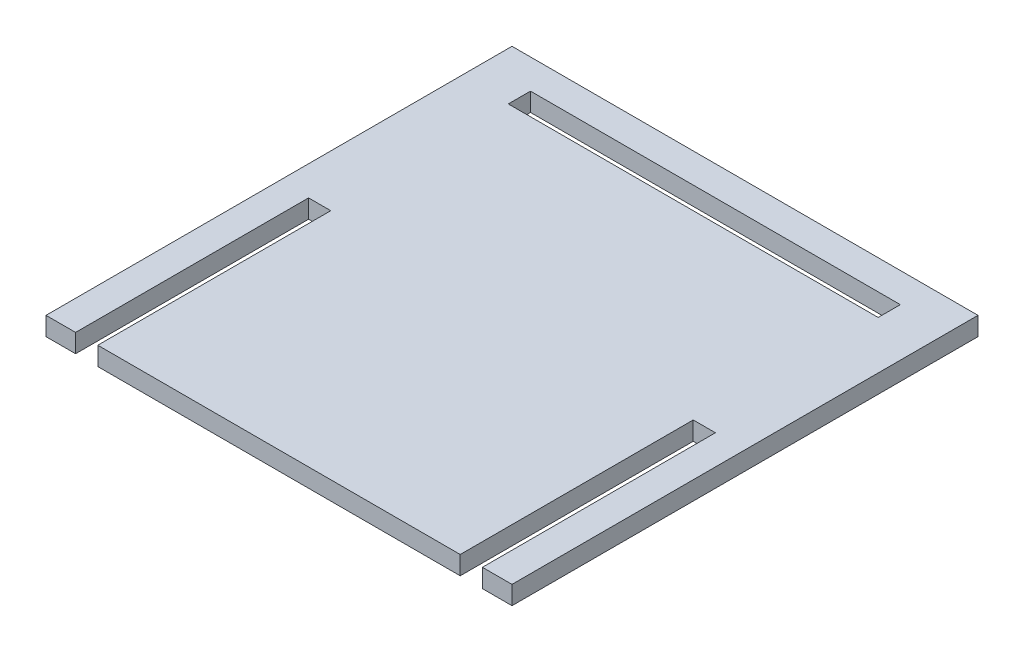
ISO-10303-21;
HEADER;
FILE_DESCRIPTION(('STEP AP214'),'2;1');
FILE_NAME('part.step','',(''),(''),'','','');
FILE_SCHEMA(('AUTOMOTIVE_DESIGN { 1 0 10303 214 1 1 1 1 }'));
ENDSEC;
DATA;
#1=APPLICATION_CONTEXT('core data for automotive mechanical design processes');
#2=APPLICATION_PROTOCOL_DEFINITION('international standard','automotive_design',2000,#1);
#3=PRODUCT_CONTEXT('',#1,'mechanical');
#4=PRODUCT('Part','Part','',(#3));
#5=PRODUCT_RELATED_PRODUCT_CATEGORY('part','',(#4));
#6=PRODUCT_DEFINITION_FORMATION('','',#4);
#7=PRODUCT_DEFINITION_CONTEXT('part definition',#1,'design');
#8=PRODUCT_DEFINITION('design','',#6,#7);
#9=PRODUCT_DEFINITION_SHAPE('','',#8);
#10=(LENGTH_UNIT() NAMED_UNIT(*) SI_UNIT(.MILLI.,.METRE.));
#11=(NAMED_UNIT(*) PLANE_ANGLE_UNIT() SI_UNIT($,.RADIAN.));
#12=(NAMED_UNIT(*) SI_UNIT($,.STERADIAN.) SOLID_ANGLE_UNIT());
#13=UNCERTAINTY_MEASURE_WITH_UNIT(LENGTH_MEASURE(1.E-05),#10,'distance_accuracy_value','');
#14=(GEOMETRIC_REPRESENTATION_CONTEXT(3) GLOBAL_UNCERTAINTY_ASSIGNED_CONTEXT((#13)) GLOBAL_UNIT_ASSIGNED_CONTEXT((#10,
#11,#12)) REPRESENTATION_CONTEXT('',''));
#15=CARTESIAN_POINT('',(0.,0.,0.));
#16=DIRECTION('',(0.,0.,1.));
#17=DIRECTION('',(1.,0.,0.));
#18=AXIS2_PLACEMENT_3D('',#15,#16,#17);
#19=CARTESIAN_POINT('',(0.,2.5,0.));
#20=DIRECTION('',(0.,-1.,0.));
#21=DIRECTION('',(0.,0.,-1.));
#22=AXIS2_PLACEMENT_3D('',#19,#20,#21);
#23=PLANE('',#22);
#24=DIRECTION('',(1.,0.,0.));
#25=VECTOR('',#24,1.);
#26=CARTESIAN_POINT('',(27.5,2.5,31.5));
#27=LINE('',#26,#25);
#28=CARTESIAN_POINT('',(27.5,2.5,31.5));
#29=VERTEX_POINT('',#28);
#30=CARTESIAN_POINT('',(31.5,2.5,31.5));
#31=VERTEX_POINT('',#30);
#32=EDGE_CURVE('E183',#29,#31,#27,.T.);
#33=ORIENTED_EDGE('',*,*,#32,.T.);
#34=DIRECTION('',(0.,0.,-1.));
#35=VECTOR('',#34,1.);
#36=CARTESIAN_POINT('',(31.5,2.5,-31.5));
#37=LINE('',#36,#35);
#38=CARTESIAN_POINT('',(31.5,2.5,-31.5));
#39=VERTEX_POINT('',#38);
#40=EDGE_CURVE('E186',#31,#39,#37,.T.);
#41=ORIENTED_EDGE('',*,*,#40,.T.);
#42=DIRECTION('',(-1.,0.,0.));
#43=VECTOR('',#42,1.);
#44=CARTESIAN_POINT('',(-31.5,2.5,-31.5));
#45=LINE('',#44,#43);
#46=CARTESIAN_POINT('',(-31.5,2.5,-31.5));
#47=VERTEX_POINT('',#46);
#48=EDGE_CURVE('E189',#39,#47,#45,.T.);
#49=ORIENTED_EDGE('',*,*,#48,.T.);
#50=DIRECTION('',(0.,0.,1.));
#51=VECTOR('',#50,1.);
#52=CARTESIAN_POINT('',(-31.5,2.5,-31.5));
#53=LINE('',#52,#51);
#54=CARTESIAN_POINT('',(-31.5,2.5,31.5));
#55=VERTEX_POINT('',#54);
#56=EDGE_CURVE('E191',#47,#55,#53,.T.);
#57=ORIENTED_EDGE('',*,*,#56,.T.);
#58=DIRECTION('',(1.,0.,0.));
#59=VECTOR('',#58,1.);
#60=CARTESIAN_POINT('',(-31.5,2.5,31.5));
#61=LINE('',#60,#59);
#62=CARTESIAN_POINT('',(-27.5,2.5,31.5));
#63=VERTEX_POINT('',#62);
#64=EDGE_CURVE('E193',#55,#63,#61,.T.);
#65=ORIENTED_EDGE('',*,*,#64,.T.);
#66=DIRECTION('',(0.,0.,-1.));
#67=VECTOR('',#66,1.);
#68=CARTESIAN_POINT('',(-27.5,2.5,31.5));
#69=LINE('',#68,#67);
#70=CARTESIAN_POINT('',(-27.5,2.5,0.));
#71=VERTEX_POINT('',#70);
#72=EDGE_CURVE('E195',#63,#71,#69,.T.);
#73=ORIENTED_EDGE('',*,*,#72,.T.);
#74=DIRECTION('',(1.,0.,0.));
#75=VECTOR('',#74,1.);
#76=CARTESIAN_POINT('',(-27.5,2.5,0.));
#77=LINE('',#76,#75);
#78=CARTESIAN_POINT('',(-24.5,2.5,0.));
#79=VERTEX_POINT('',#78);
#80=EDGE_CURVE('E197',#71,#79,#77,.T.);
#81=ORIENTED_EDGE('',*,*,#80,.T.);
#82=DIRECTION('',(0.,0.,1.));
#83=VECTOR('',#82,1.);
#84=CARTESIAN_POINT('',(-24.5,2.5,0.));
#85=LINE('',#84,#83);
#86=CARTESIAN_POINT('',(-24.5,2.5,31.5));
#87=VERTEX_POINT('',#86);
#88=EDGE_CURVE('E199',#79,#87,#85,.T.);
#89=ORIENTED_EDGE('',*,*,#88,.T.);
#90=DIRECTION('',(1.,0.,0.));
#91=VECTOR('',#90,1.);
#92=CARTESIAN_POINT('',(-24.5,2.5,31.5));
#93=LINE('',#92,#91);
#94=CARTESIAN_POINT('',(24.5,2.5,31.5));
#95=VERTEX_POINT('',#94);
#96=EDGE_CURVE('E201',#87,#95,#93,.T.);
#97=ORIENTED_EDGE('',*,*,#96,.T.);
#98=DIRECTION('',(0.,0.,-1.));
#99=VECTOR('',#98,1.);
#100=CARTESIAN_POINT('',(24.5,2.5,0.));
#101=LINE('',#100,#99);
#102=CARTESIAN_POINT('',(24.5,2.5,0.));
#103=VERTEX_POINT('',#102);
#104=EDGE_CURVE('E203',#95,#103,#101,.T.);
#105=ORIENTED_EDGE('',*,*,#104,.T.);
#106=DIRECTION('',(1.,0.,0.));
#107=VECTOR('',#106,1.);
#108=CARTESIAN_POINT('',(27.5,2.5,0.));
#109=LINE('',#108,#107);
#110=CARTESIAN_POINT('',(27.5,2.5,0.));
#111=VERTEX_POINT('',#110);
#112=EDGE_CURVE('E205',#103,#111,#109,.T.);
#113=ORIENTED_EDGE('',*,*,#112,.T.);
#114=DIRECTION('',(0.,0.,1.));
#115=VECTOR('',#114,1.);
#116=CARTESIAN_POINT('',(27.5,2.5,31.5));
#117=LINE('',#116,#115);
#118=EDGE_CURVE('E207',#111,#29,#117,.T.);
#119=ORIENTED_EDGE('',*,*,#118,.T.);
#120=EDGE_LOOP('',(#33,#41,#49,#57,#65,#73,#81,#89,#97,#105,#113,#119));
#121=FACE_BOUND('',#120,.T.);
#122=DIRECTION('',(0.,0.,-1.));
#123=VECTOR('',#122,1.);
#124=CARTESIAN_POINT('',(25.,2.5,-27.5));
#125=LINE('',#124,#123);
#126=CARTESIAN_POINT('',(25.,2.5,-24.5));
#127=VERTEX_POINT('',#126);
#128=CARTESIAN_POINT('',(25.,2.5,-27.5));
#129=VERTEX_POINT('',#128);
#130=EDGE_CURVE('E147',#127,#129,#125,.T.);
#131=ORIENTED_EDGE('',*,*,#130,.F.);
#132=DIRECTION('',(1.,0.,0.));
#133=VECTOR('',#132,1.);
#134=CARTESIAN_POINT('',(-25.,2.5,-24.5));
#135=LINE('',#134,#133);
#136=CARTESIAN_POINT('',(-25.,2.5,-24.5));
#137=VERTEX_POINT('',#136);
#138=EDGE_CURVE('E169',#137,#127,#135,.T.);
#139=ORIENTED_EDGE('',*,*,#138,.F.);
#140=DIRECTION('',(0.,0.,1.));
#141=VECTOR('',#140,1.);
#142=CARTESIAN_POINT('',(-25.,2.5,-27.5));
#143=LINE('',#142,#141);
#144=CARTESIAN_POINT('',(-25.,2.5,-27.5));
#145=VERTEX_POINT('',#144);
#146=EDGE_CURVE('E167',#145,#137,#143,.T.);
#147=ORIENTED_EDGE('',*,*,#146,.F.);
#148=DIRECTION('',(-1.,0.,0.));
#149=VECTOR('',#148,1.);
#150=CARTESIAN_POINT('',(-25.,2.5,-27.5));
#151=LINE('',#150,#149);
#152=EDGE_CURVE('E155',#129,#145,#151,.T.);
#153=ORIENTED_EDGE('',*,*,#152,.F.);
#154=EDGE_LOOP('',(#131,#139,#147,#153));
#155=FACE_BOUND('',#154,.T.);
#156=ADVANCED_FACE('F34',(#121,#155),#23,.F.);
#157=CARTESIAN_POINT('',(0.,0.,0.));
#158=DIRECTION('',(0.,-1.,0.));
#159=DIRECTION('',(0.,0.,-1.));
#160=AXIS2_PLACEMENT_3D('',#157,#158,#159);
#161=PLANE('',#160);
#162=DIRECTION('',(1.,0.,0.));
#163=VECTOR('',#162,1.);
#164=CARTESIAN_POINT('',(27.5,0.,31.5));
#165=LINE('',#164,#163);
#166=CARTESIAN_POINT('',(27.5,0.,31.5));
#167=VERTEX_POINT('',#166);
#168=CARTESIAN_POINT('',(31.5,0.,31.5));
#169=VERTEX_POINT('',#168);
#170=EDGE_CURVE('E163',#167,#169,#165,.T.);
#171=ORIENTED_EDGE('',*,*,#170,.F.);
#172=DIRECTION('',(0.,0.,1.));
#173=VECTOR('',#172,1.);
#174=CARTESIAN_POINT('',(27.5,0.,31.5));
#175=LINE('',#174,#173);
#176=CARTESIAN_POINT('',(27.5,0.,0.));
#177=VERTEX_POINT('',#176);
#178=EDGE_CURVE('E187',#177,#167,#175,.T.);
#179=ORIENTED_EDGE('',*,*,#178,.F.);
#180=DIRECTION('',(1.,0.,0.));
#181=VECTOR('',#180,1.);
#182=CARTESIAN_POINT('',(27.5,0.,0.));
#183=LINE('',#182,#181);
#184=CARTESIAN_POINT('',(24.5,0.,0.));
#185=VERTEX_POINT('',#184);
#186=EDGE_CURVE('E230',#185,#177,#183,.T.);
#187=ORIENTED_EDGE('',*,*,#186,.F.);
#188=DIRECTION('',(0.,0.,-1.));
#189=VECTOR('',#188,1.);
#190=CARTESIAN_POINT('',(24.5,0.,0.));
#191=LINE('',#190,#189);
#192=CARTESIAN_POINT('',(24.5,0.,31.5));
#193=VERTEX_POINT('',#192);
#194=EDGE_CURVE('E228',#193,#185,#191,.T.);
#195=ORIENTED_EDGE('',*,*,#194,.F.);
#196=DIRECTION('',(1.,0.,0.));
#197=VECTOR('',#196,1.);
#198=CARTESIAN_POINT('',(-24.5,0.,31.5));
#199=LINE('',#198,#197);
#200=CARTESIAN_POINT('',(-24.5,0.,31.5));
#201=VERTEX_POINT('',#200);
#202=EDGE_CURVE('E226',#201,#193,#199,.T.);
#203=ORIENTED_EDGE('',*,*,#202,.F.);
#204=DIRECTION('',(0.,0.,1.));
#205=VECTOR('',#204,1.);
#206=CARTESIAN_POINT('',(-24.5,0.,0.));
#207=LINE('',#206,#205);
#208=CARTESIAN_POINT('',(-24.5,0.,0.));
#209=VERTEX_POINT('',#208);
#210=EDGE_CURVE('E224',#209,#201,#207,.T.);
#211=ORIENTED_EDGE('',*,*,#210,.F.);
#212=DIRECTION('',(1.,0.,0.));
#213=VECTOR('',#212,1.);
#214=CARTESIAN_POINT('',(-27.5,0.,0.));
#215=LINE('',#214,#213);
#216=CARTESIAN_POINT('',(-27.5,0.,0.));
#217=VERTEX_POINT('',#216);
#218=EDGE_CURVE('E222',#217,#209,#215,.T.);
#219=ORIENTED_EDGE('',*,*,#218,.F.);
#220=DIRECTION('',(0.,0.,-1.));
#221=VECTOR('',#220,1.);
#222=CARTESIAN_POINT('',(-27.5,0.,31.5));
#223=LINE('',#222,#221);
#224=CARTESIAN_POINT('',(-27.5,0.,31.5));
#225=VERTEX_POINT('',#224);
#226=EDGE_CURVE('E220',#225,#217,#223,.T.);
#227=ORIENTED_EDGE('',*,*,#226,.F.);
#228=DIRECTION('',(1.,0.,0.));
#229=VECTOR('',#228,1.);
#230=CARTESIAN_POINT('',(-31.5,0.,31.5));
#231=LINE('',#230,#229);
#232=CARTESIAN_POINT('',(-31.5,0.,31.5));
#233=VERTEX_POINT('',#232);
#234=EDGE_CURVE('E218',#233,#225,#231,.T.);
#235=ORIENTED_EDGE('',*,*,#234,.F.);
#236=DIRECTION('',(0.,0.,1.));
#237=VECTOR('',#236,1.);
#238=CARTESIAN_POINT('',(-31.5,0.,-31.5));
#239=LINE('',#238,#237);
#240=CARTESIAN_POINT('',(-31.5,0.,-31.5));
#241=VERTEX_POINT('',#240);
#242=EDGE_CURVE('E216',#241,#233,#239,.T.);
#243=ORIENTED_EDGE('',*,*,#242,.F.);
#244=DIRECTION('',(-1.,0.,0.));
#245=VECTOR('',#244,1.);
#246=CARTESIAN_POINT('',(-31.5,0.,-31.5));
#247=LINE('',#246,#245);
#248=CARTESIAN_POINT('',(31.5,0.,-31.5));
#249=VERTEX_POINT('',#248);
#250=EDGE_CURVE('E214',#249,#241,#247,.T.);
#251=ORIENTED_EDGE('',*,*,#250,.F.);
#252=DIRECTION('',(0.,0.,-1.));
#253=VECTOR('',#252,1.);
#254=CARTESIAN_POINT('',(31.5,0.,-31.5));
#255=LINE('',#254,#253);
#256=EDGE_CURVE('E212',#169,#249,#255,.T.);
#257=ORIENTED_EDGE('',*,*,#256,.F.);
#258=EDGE_LOOP('',(#171,#179,#187,#195,#203,#211,#219,#227,#235,#243,#251,#257));
#259=FACE_BOUND('',#258,.T.);
#260=DIRECTION('',(1.,0.,0.));
#261=VECTOR('',#260,1.);
#262=CARTESIAN_POINT('',(-25.,0.,-24.5));
#263=LINE('',#262,#261);
#264=CARTESIAN_POINT('',(-25.,0.,-24.5));
#265=VERTEX_POINT('',#264);
#266=CARTESIAN_POINT('',(25.,0.,-24.5));
#267=VERTEX_POINT('',#266);
#268=EDGE_CURVE('E156',#265,#267,#263,.T.);
#269=ORIENTED_EDGE('',*,*,#268,.T.);
#270=DIRECTION('',(0.,0.,-1.));
#271=VECTOR('',#270,1.);
#272=CARTESIAN_POINT('',(25.,0.,-27.5));
#273=LINE('',#272,#271);
#274=CARTESIAN_POINT('',(25.,0.,-27.5));
#275=VERTEX_POINT('',#274);
#276=EDGE_CURVE('E57',#267,#275,#273,.T.);
#277=ORIENTED_EDGE('',*,*,#276,.T.);
#278=DIRECTION('',(-1.,0.,0.));
#279=VECTOR('',#278,1.);
#280=CARTESIAN_POINT('',(-25.,0.,-27.5));
#281=LINE('',#280,#279);
#282=CARTESIAN_POINT('',(-25.,0.,-27.5));
#283=VERTEX_POINT('',#282);
#284=EDGE_CURVE('E162',#275,#283,#281,.T.);
#285=ORIENTED_EDGE('',*,*,#284,.T.);
#286=DIRECTION('',(0.,0.,1.));
#287=VECTOR('',#286,1.);
#288=CARTESIAN_POINT('',(-25.,0.,-27.5));
#289=LINE('',#288,#287);
#290=EDGE_CURVE('E175',#283,#265,#289,.T.);
#291=ORIENTED_EDGE('',*,*,#290,.T.);
#292=EDGE_LOOP('',(#269,#277,#285,#291));
#293=FACE_BOUND('',#292,.T.);
#294=ADVANCED_FACE('F272',(#259,#293),#161,.T.);
#295=CARTESIAN_POINT('',(27.5,2.5,31.5));
#296=DIRECTION('',(0.,0.,-1.));
#297=DIRECTION('',(-1.,0.,0.));
#298=AXIS2_PLACEMENT_3D('',#295,#296,#297);
#299=PLANE('',#298);
#300=ORIENTED_EDGE('',*,*,#170,.T.);
#301=DIRECTION('',(0.,-1.,0.));
#302=VECTOR('',#301,1.);
#303=CARTESIAN_POINT('',(31.5,2.5,31.5));
#304=LINE('',#303,#302);
#305=EDGE_CURVE('E11',#31,#169,#304,.T.);
#306=ORIENTED_EDGE('',*,*,#305,.F.);
#307=ORIENTED_EDGE('',*,*,#32,.F.);
#308=DIRECTION('',(0.,-1.,0.));
#309=VECTOR('',#308,1.);
#310=CARTESIAN_POINT('',(27.5,2.5,31.5));
#311=LINE('',#310,#309);
#312=EDGE_CURVE('E209',#29,#167,#311,.T.);
#313=ORIENTED_EDGE('',*,*,#312,.T.);
#314=EDGE_LOOP('',(#300,#306,#307,#313));
#315=FACE_BOUND('',#314,.T.);
#316=ADVANCED_FACE('F36',(#315),#299,.F.);
#317=CARTESIAN_POINT('',(31.5,2.5,-31.5));
#318=DIRECTION('',(-1.,0.,0.));
#319=DIRECTION('',(0.,0.,1.));
#320=AXIS2_PLACEMENT_3D('',#317,#318,#319);
#321=PLANE('',#320);
#322=ORIENTED_EDGE('',*,*,#256,.T.);
#323=DIRECTION('',(0.,-1.,0.));
#324=VECTOR('',#323,1.);
#325=CARTESIAN_POINT('',(31.5,2.5,-31.5));
#326=LINE('',#325,#324);
#327=EDGE_CURVE('E42',#39,#249,#326,.T.);
#328=ORIENTED_EDGE('',*,*,#327,.F.);
#329=ORIENTED_EDGE('',*,*,#40,.F.);
#330=ORIENTED_EDGE('',*,*,#305,.T.);
#331=EDGE_LOOP('',(#322,#328,#329,#330));
#332=FACE_BOUND('',#331,.T.);
#333=ADVANCED_FACE('F289',(#332),#321,.F.);
#334=CARTESIAN_POINT('',(-31.5,2.5,-31.5));
#335=DIRECTION('',(0.,0.,1.));
#336=DIRECTION('',(1.,0.,0.));
#337=AXIS2_PLACEMENT_3D('',#334,#335,#336);
#338=PLANE('',#337);
#339=ORIENTED_EDGE('',*,*,#250,.T.);
#340=DIRECTION('',(0.,-1.,0.));
#341=VECTOR('',#340,1.);
#342=CARTESIAN_POINT('',(-31.5,2.5,-31.5));
#343=LINE('',#342,#341);
#344=EDGE_CURVE('E259',#47,#241,#343,.T.);
#345=ORIENTED_EDGE('',*,*,#344,.F.);
#346=ORIENTED_EDGE('',*,*,#48,.F.);
#347=ORIENTED_EDGE('',*,*,#327,.T.);
#348=EDGE_LOOP('',(#339,#345,#346,#347));
#349=FACE_BOUND('',#348,.T.);
#350=ADVANCED_FACE('F266',(#349),#338,.F.);
#351=CARTESIAN_POINT('',(-31.5,2.5,-31.5));
#352=DIRECTION('',(1.,0.,0.));
#353=DIRECTION('',(0.,0.,-1.));
#354=AXIS2_PLACEMENT_3D('',#351,#352,#353);
#355=PLANE('',#354);
#356=ORIENTED_EDGE('',*,*,#242,.T.);
#357=DIRECTION('',(0.,-1.,0.));
#358=VECTOR('',#357,1.);
#359=CARTESIAN_POINT('',(-31.5,2.5,31.5));
#360=LINE('',#359,#358);
#361=EDGE_CURVE('E256',#55,#233,#360,.T.);
#362=ORIENTED_EDGE('',*,*,#361,.F.);
#363=ORIENTED_EDGE('',*,*,#56,.F.);
#364=ORIENTED_EDGE('',*,*,#344,.T.);
#365=EDGE_LOOP('',(#356,#362,#363,#364));
#366=FACE_BOUND('',#365,.T.);
#367=ADVANCED_FACE('F278',(#366),#355,.F.);
#368=CARTESIAN_POINT('',(-31.5,2.5,31.5));
#369=DIRECTION('',(0.,0.,-1.));
#370=DIRECTION('',(-1.,0.,0.));
#371=AXIS2_PLACEMENT_3D('',#368,#369,#370);
#372=PLANE('',#371);
#373=ORIENTED_EDGE('',*,*,#234,.T.);
#374=DIRECTION('',(0.,-1.,0.));
#375=VECTOR('',#374,1.);
#376=CARTESIAN_POINT('',(-27.5,2.5,31.5));
#377=LINE('',#376,#375);
#378=EDGE_CURVE('E253',#63,#225,#377,.T.);
#379=ORIENTED_EDGE('',*,*,#378,.F.);
#380=ORIENTED_EDGE('',*,*,#64,.F.);
#381=ORIENTED_EDGE('',*,*,#361,.T.);
#382=EDGE_LOOP('',(#373,#379,#380,#381));
#383=FACE_BOUND('',#382,.T.);
#384=ADVANCED_FACE('F282',(#383),#372,.F.);
#385=CARTESIAN_POINT('',(-27.5,2.5,31.5));
#386=DIRECTION('',(-1.,0.,0.));
#387=DIRECTION('',(0.,0.,1.));
#388=AXIS2_PLACEMENT_3D('',#385,#386,#387);
#389=PLANE('',#388);
#390=ORIENTED_EDGE('',*,*,#226,.T.);
#391=DIRECTION('',(0.,-1.,0.));
#392=VECTOR('',#391,1.);
#393=CARTESIAN_POINT('',(-27.5,2.5,0.));
#394=LINE('',#393,#392);
#395=EDGE_CURVE('E250',#71,#217,#394,.T.);
#396=ORIENTED_EDGE('',*,*,#395,.F.);
#397=ORIENTED_EDGE('',*,*,#72,.F.);
#398=ORIENTED_EDGE('',*,*,#378,.T.);
#399=EDGE_LOOP('',(#390,#396,#397,#398));
#400=FACE_BOUND('',#399,.T.);
#401=ADVANCED_FACE('F322',(#400),#389,.F.);
#402=CARTESIAN_POINT('',(-27.5,2.5,0.));
#403=DIRECTION('',(0.,0.,-1.));
#404=DIRECTION('',(-1.,0.,0.));
#405=AXIS2_PLACEMENT_3D('',#402,#403,#404);
#406=PLANE('',#405);
#407=ORIENTED_EDGE('',*,*,#218,.T.);
#408=DIRECTION('',(0.,-1.,0.));
#409=VECTOR('',#408,1.);
#410=CARTESIAN_POINT('',(-24.5,2.5,0.));
#411=LINE('',#410,#409);
#412=EDGE_CURVE('E247',#79,#209,#411,.T.);
#413=ORIENTED_EDGE('',*,*,#412,.F.);
#414=ORIENTED_EDGE('',*,*,#80,.F.);
#415=ORIENTED_EDGE('',*,*,#395,.T.);
#416=EDGE_LOOP('',(#407,#413,#414,#415));
#417=FACE_BOUND('',#416,.T.);
#418=ADVANCED_FACE('F320',(#417),#406,.F.);
#419=CARTESIAN_POINT('',(-24.5,2.5,0.));
#420=DIRECTION('',(1.,0.,0.));
#421=DIRECTION('',(0.,0.,-1.));
#422=AXIS2_PLACEMENT_3D('',#419,#420,#421);
#423=PLANE('',#422);
#424=ORIENTED_EDGE('',*,*,#210,.T.);
#425=DIRECTION('',(0.,-1.,0.));
#426=VECTOR('',#425,1.);
#427=CARTESIAN_POINT('',(-24.5,2.5,31.5));
#428=LINE('',#427,#426);
#429=EDGE_CURVE('E244',#87,#201,#428,.T.);
#430=ORIENTED_EDGE('',*,*,#429,.F.);
#431=ORIENTED_EDGE('',*,*,#88,.F.);
#432=ORIENTED_EDGE('',*,*,#412,.T.);
#433=EDGE_LOOP('',(#424,#430,#431,#432));
#434=FACE_BOUND('',#433,.T.);
#435=ADVANCED_FACE('F316',(#434),#423,.F.);
#436=CARTESIAN_POINT('',(-24.5,2.5,31.5));
#437=DIRECTION('',(0.,0.,-1.));
#438=DIRECTION('',(-1.,0.,0.));
#439=AXIS2_PLACEMENT_3D('',#436,#437,#438);
#440=PLANE('',#439);
#441=ORIENTED_EDGE('',*,*,#202,.T.);
#442=DIRECTION('',(0.,-1.,0.));
#443=VECTOR('',#442,1.);
#444=CARTESIAN_POINT('',(24.5,2.5,31.5));
#445=LINE('',#444,#443);
#446=EDGE_CURVE('E241',#95,#193,#445,.T.);
#447=ORIENTED_EDGE('',*,*,#446,.F.);
#448=ORIENTED_EDGE('',*,*,#96,.F.);
#449=ORIENTED_EDGE('',*,*,#429,.T.);
#450=EDGE_LOOP('',(#441,#447,#448,#449));
#451=FACE_BOUND('',#450,.T.);
#452=ADVANCED_FACE('F311',(#451),#440,.F.);
#453=CARTESIAN_POINT('',(24.5,2.5,0.));
#454=DIRECTION('',(-1.,0.,0.));
#455=DIRECTION('',(0.,0.,1.));
#456=AXIS2_PLACEMENT_3D('',#453,#454,#455);
#457=PLANE('',#456);
#458=ORIENTED_EDGE('',*,*,#194,.T.);
#459=DIRECTION('',(0.,-1.,0.));
#460=VECTOR('',#459,1.);
#461=CARTESIAN_POINT('',(24.5,2.5,0.));
#462=LINE('',#461,#460);
#463=EDGE_CURVE('E238',#103,#185,#462,.T.);
#464=ORIENTED_EDGE('',*,*,#463,.F.);
#465=ORIENTED_EDGE('',*,*,#104,.F.);
#466=ORIENTED_EDGE('',*,*,#446,.T.);
#467=EDGE_LOOP('',(#458,#464,#465,#466));
#468=FACE_BOUND('',#467,.T.);
#469=ADVANCED_FACE('F305',(#468),#457,.F.);
#470=CARTESIAN_POINT('',(27.5,2.5,0.));
#471=DIRECTION('',(0.,0.,-1.));
#472=DIRECTION('',(-1.,0.,0.));
#473=AXIS2_PLACEMENT_3D('',#470,#471,#472);
#474=PLANE('',#473);
#475=ORIENTED_EDGE('',*,*,#186,.T.);
#476=DIRECTION('',(0.,-1.,0.));
#477=VECTOR('',#476,1.);
#478=CARTESIAN_POINT('',(27.5,2.5,0.));
#479=LINE('',#478,#477);
#480=EDGE_CURVE('E235',#111,#177,#479,.T.);
#481=ORIENTED_EDGE('',*,*,#480,.F.);
#482=ORIENTED_EDGE('',*,*,#112,.F.);
#483=ORIENTED_EDGE('',*,*,#463,.T.);
#484=EDGE_LOOP('',(#475,#481,#482,#483));
#485=FACE_BOUND('',#484,.T.);
#486=ADVANCED_FACE('F301',(#485),#474,.F.);
#487=CARTESIAN_POINT('',(27.5,2.5,31.5));
#488=DIRECTION('',(1.,0.,0.));
#489=DIRECTION('',(0.,0.,-1.));
#490=AXIS2_PLACEMENT_3D('',#487,#488,#489);
#491=PLANE('',#490);
#492=ORIENTED_EDGE('',*,*,#178,.T.);
#493=ORIENTED_EDGE('',*,*,#312,.F.);
#494=ORIENTED_EDGE('',*,*,#118,.F.);
#495=ORIENTED_EDGE('',*,*,#480,.T.);
#496=EDGE_LOOP('',(#492,#493,#494,#495));
#497=FACE_BOUND('',#496,.T.);
#498=ADVANCED_FACE('F296',(#497),#491,.F.);
#499=CARTESIAN_POINT('',(25.,2.5,-27.5));
#500=DIRECTION('',(-1.,0.,0.));
#501=DIRECTION('',(0.,0.,1.));
#502=AXIS2_PLACEMENT_3D('',#499,#500,#501);
#503=PLANE('',#502);
#504=ORIENTED_EDGE('',*,*,#276,.F.);
#505=DIRECTION('',(0.,-1.,0.));
#506=VECTOR('',#505,1.);
#507=CARTESIAN_POINT('',(25.,2.5,-24.5));
#508=LINE('',#507,#506);
#509=EDGE_CURVE('E151',#127,#267,#508,.T.);
#510=ORIENTED_EDGE('',*,*,#509,.F.);
#511=ORIENTED_EDGE('',*,*,#130,.T.);
#512=DIRECTION('',(0.,-1.,0.));
#513=VECTOR('',#512,1.);
#514=CARTESIAN_POINT('',(25.,2.5,-27.5));
#515=LINE('',#514,#513);
#516=EDGE_CURVE('E150',#129,#275,#515,.T.);
#517=ORIENTED_EDGE('',*,*,#516,.T.);
#518=EDGE_LOOP('',(#504,#510,#511,#517));
#519=FACE_BOUND('',#518,.T.);
#520=ADVANCED_FACE('F149',(#519),#503,.T.);
#521=CARTESIAN_POINT('',(-25.,2.5,-27.5));
#522=DIRECTION('',(0.,0.,1.));
#523=DIRECTION('',(1.,0.,0.));
#524=AXIS2_PLACEMENT_3D('',#521,#522,#523);
#525=PLANE('',#524);
#526=ORIENTED_EDGE('',*,*,#284,.F.);
#527=ORIENTED_EDGE('',*,*,#516,.F.);
#528=ORIENTED_EDGE('',*,*,#152,.T.);
#529=DIRECTION('',(0.,-1.,0.));
#530=VECTOR('',#529,1.);
#531=CARTESIAN_POINT('',(-25.,2.5,-27.5));
#532=LINE('',#531,#530);
#533=EDGE_CURVE('E164',#145,#283,#532,.T.);
#534=ORIENTED_EDGE('',*,*,#533,.T.);
#535=EDGE_LOOP('',(#526,#527,#528,#534));
#536=FACE_BOUND('',#535,.T.);
#537=ADVANCED_FACE('F159',(#536),#525,.T.);
#538=CARTESIAN_POINT('',(-25.,2.5,-27.5));
#539=DIRECTION('',(1.,0.,0.));
#540=DIRECTION('',(0.,0.,-1.));
#541=AXIS2_PLACEMENT_3D('',#538,#539,#540);
#542=PLANE('',#541);
#543=ORIENTED_EDGE('',*,*,#290,.F.);
#544=ORIENTED_EDGE('',*,*,#533,.F.);
#545=ORIENTED_EDGE('',*,*,#146,.T.);
#546=DIRECTION('',(0.,-1.,0.));
#547=VECTOR('',#546,1.);
#548=CARTESIAN_POINT('',(-25.,2.5,-24.5));
#549=LINE('',#548,#547);
#550=EDGE_CURVE('E49',#137,#265,#549,.T.);
#551=ORIENTED_EDGE('',*,*,#550,.T.);
#552=EDGE_LOOP('',(#543,#544,#545,#551));
#553=FACE_BOUND('',#552,.T.);
#554=ADVANCED_FACE('F385',(#553),#542,.T.);
#555=CARTESIAN_POINT('',(-25.,2.5,-24.5));
#556=DIRECTION('',(0.,0.,-1.));
#557=DIRECTION('',(-1.,0.,0.));
#558=AXIS2_PLACEMENT_3D('',#555,#556,#557);
#559=PLANE('',#558);
#560=ORIENTED_EDGE('',*,*,#268,.F.);
#561=ORIENTED_EDGE('',*,*,#550,.F.);
#562=ORIENTED_EDGE('',*,*,#138,.T.);
#563=ORIENTED_EDGE('',*,*,#509,.T.);
#564=EDGE_LOOP('',(#560,#561,#562,#563));
#565=FACE_BOUND('',#564,.T.);
#566=ADVANCED_FACE('F391',(#565),#559,.T.);
#567=CLOSED_SHELL('',(#156,#294,#316,#333,#350,#367,#384,#401,#418,#435,#452,#469,#486,#498,
#520,#537,#554,#566));
#568=MANIFOLD_SOLID_BREP('B2',#567);
#569=ADVANCED_BREP_SHAPE_REPRESENTATION('',(#18,#568),#14);
#570=SHAPE_DEFINITION_REPRESENTATION(#9,#569);
ENDSEC;
END-ISO-10303-21;
